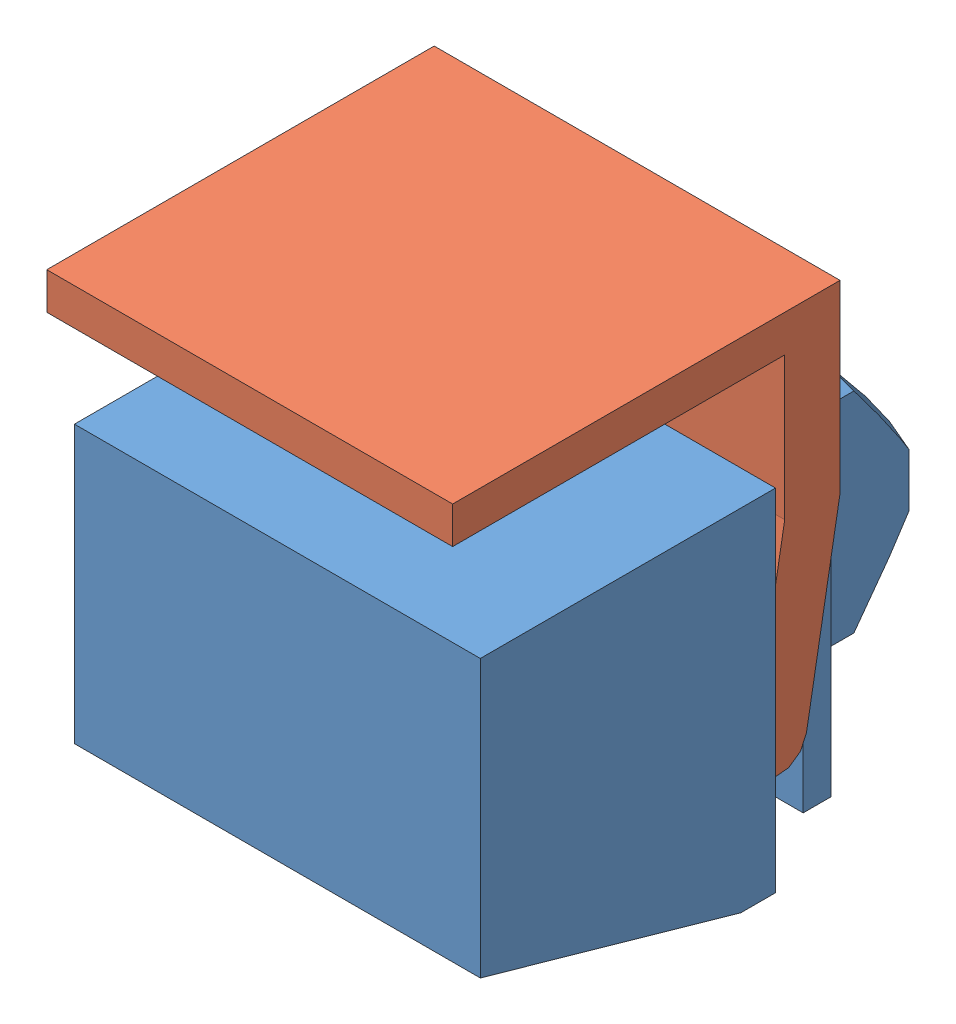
SolidWorks assembly 22.1111_1 PANEL CLAMP BLOCK 45.SLDASM, configuration Default (file format 3800). Lengths in mm.
Overall size (22 27 32).
2 component instances, 2 part files, 3 mates.
Components (placement in the parent):
- 22.1111_1 PANEL CLAMP BLOCK 45 CATCH-1: 22.1111_1 PANEL CLAMP BLOCK 45 CATCH.SLDPRT [Default] at origin size (22 21 30.5)
- 22.1111_1 PANEL CLAMP BLOCK 45 CLIP-1: 22.1111_1 PANEL CLAMP BLOCK 45 CLIP.SLDPRT [Default] at (0 0 1.3) size (22 21.58 21)
Mates (geometry in assembly coordinates):
- Distance1: distance = 6 mm: plane of 22.1111_1 PANEL CLAMP BLOCK 45 CATCH-1 through (-11 10.5 21) normal (0 1 0); plane of 22.1111_1 PANEL CLAMP BLOCK 45 CLIP-1 through (-11 16.5 1.5) normal (0 -1 0)
- Coincident2: coincident: plane of 22.1111_1 PANEL CLAMP BLOCK 45 CATCH-1 through (11 -8.5 6.8769) normal (1 0 0); plane of ? through (11 16.5 23.6585) normal (1 0 0)
- Coincident3: coincident anti-aligned: plane of 22.1111_1 PANEL CLAMP BLOCK 45 CATCH-1 through (3.5 12.5 1.5) normal (0 0 1); plane of ? through (-11 18.5 2.6585) normal (0 0 -1)
